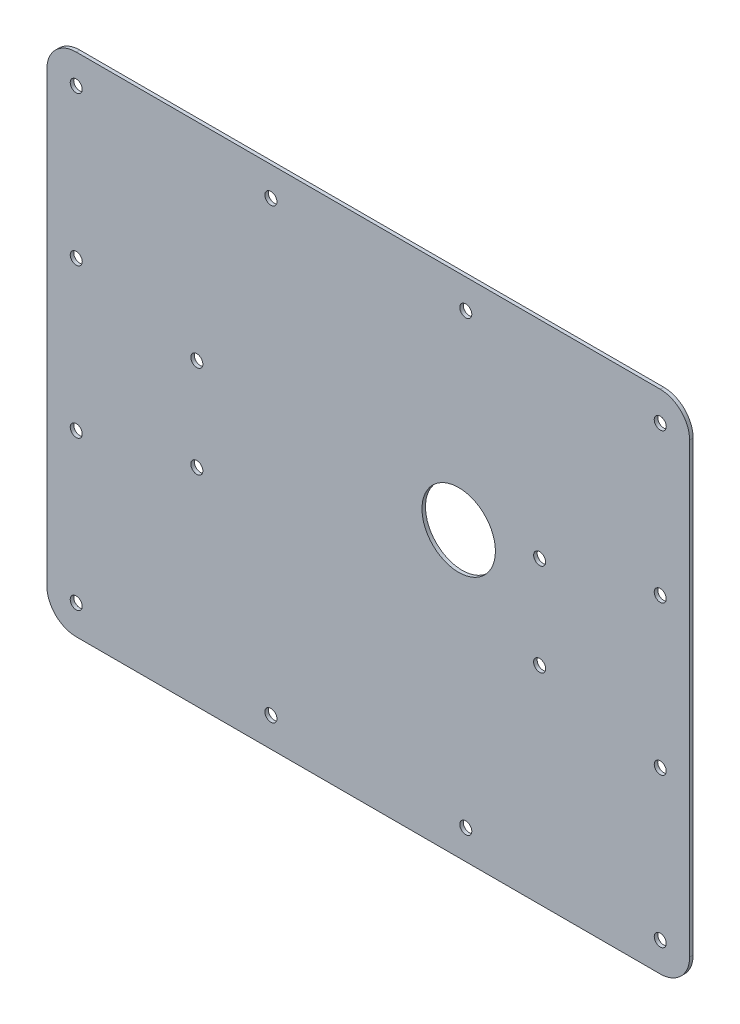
ISO-10303-21;
HEADER;
FILE_DESCRIPTION(('STEP AP214'),'2;1');
FILE_NAME('part.step','',(''),(''),'','','');
FILE_SCHEMA(('AUTOMOTIVE_DESIGN { 1 0 10303 214 1 1 1 1 }'));
ENDSEC;
DATA;
#1=APPLICATION_CONTEXT('core data for automotive mechanical design processes');
#2=APPLICATION_PROTOCOL_DEFINITION('international standard','automotive_design',2000,#1);
#3=PRODUCT_CONTEXT('',#1,'mechanical');
#4=PRODUCT('Part','Part','',(#3));
#5=PRODUCT_RELATED_PRODUCT_CATEGORY('part','',(#4));
#6=PRODUCT_DEFINITION_FORMATION('','',#4);
#7=PRODUCT_DEFINITION_CONTEXT('part definition',#1,'design');
#8=PRODUCT_DEFINITION('design','',#6,#7);
#9=PRODUCT_DEFINITION_SHAPE('','',#8);
#10=(LENGTH_UNIT() NAMED_UNIT(*) SI_UNIT(.MILLI.,.METRE.));
#11=(NAMED_UNIT(*) PLANE_ANGLE_UNIT() SI_UNIT($,.RADIAN.));
#12=(NAMED_UNIT(*) SI_UNIT($,.STERADIAN.) SOLID_ANGLE_UNIT());
#13=UNCERTAINTY_MEASURE_WITH_UNIT(LENGTH_MEASURE(1.E-05),#10,'distance_accuracy_value','');
#14=(GEOMETRIC_REPRESENTATION_CONTEXT(3) GLOBAL_UNCERTAINTY_ASSIGNED_CONTEXT((#13)) GLOBAL_UNIT_ASSIGNED_CONTEXT((#10,
#11,#12)) REPRESENTATION_CONTEXT('',''));
#15=CARTESIAN_POINT('',(0.,0.,0.));
#16=DIRECTION('',(0.,0.,1.));
#17=DIRECTION('',(1.,0.,0.));
#18=AXIS2_PLACEMENT_3D('',#15,#16,#17);
#19=CARTESIAN_POINT('',(126.238,96.774,1.51892));
#20=DIRECTION('',(0.,0.,1.));
#21=DIRECTION('',(1.,0.,0.));
#22=AXIS2_PLACEMENT_3D('',#19,#20,#21);
#23=PLANE('',#22);
#24=CARTESIAN_POINT('',(42.164,96.774,1.51892));
#25=DIRECTION('',(0.,0.,1.));
#26=DIRECTION('',(-1.,0.,0.));
#27=AXIS2_PLACEMENT_3D('',#24,#25,#26);
#28=CIRCLE('',#27,2.6);
#29=CARTESIAN_POINT('',(39.564,96.774,1.51892));
#30=VERTEX_POINT('',#29);
#31=EDGE_CURVE('E275',#30,#30,#28,.T.);
#32=ORIENTED_EDGE('',*,*,#31,.F.);
#33=EDGE_LOOP('',(#32));
#34=FACE_BOUND('',#33,.T.);
#35=CARTESIAN_POINT('',(-42.0793333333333,-96.774,1.51892));
#36=DIRECTION('',(0.,0.,1.));
#37=DIRECTION('',(1.,0.,0.));
#38=AXIS2_PLACEMENT_3D('',#35,#36,#37);
#39=CIRCLE('',#38,2.6);
#40=CARTESIAN_POINT('',(-39.4793333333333,-96.774,1.51892));
#41=VERTEX_POINT('',#40);
#42=EDGE_CURVE('E263',#41,#41,#39,.T.);
#43=ORIENTED_EDGE('',*,*,#42,.F.);
#44=EDGE_LOOP('',(#43));
#45=FACE_BOUND('',#44,.T.);
#46=CARTESIAN_POINT('',(126.238,-32.258,1.51892));
#47=DIRECTION('',(0.,0.,1.));
#48=DIRECTION('',(-1.,0.,0.));
#49=AXIS2_PLACEMENT_3D('',#46,#47,#48);
#50=CIRCLE('',#49,2.59999999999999);
#51=CARTESIAN_POINT('',(123.638,-32.258,1.51892));
#52=VERTEX_POINT('',#51);
#53=EDGE_CURVE('E251',#52,#52,#50,.T.);
#54=ORIENTED_EDGE('',*,*,#53,.F.);
#55=EDGE_LOOP('',(#54));
#56=FACE_BOUND('',#55,.T.);
#57=CARTESIAN_POINT('',(-126.238,-32.258,1.51892));
#58=DIRECTION('',(0.,0.,1.));
#59=DIRECTION('',(1.,0.,0.));
#60=AXIS2_PLACEMENT_3D('',#57,#58,#59);
#61=CIRCLE('',#60,2.6);
#62=CARTESIAN_POINT('',(-123.638,-32.258,1.51892));
#63=VERTEX_POINT('',#62);
#64=EDGE_CURVE('E239',#63,#63,#61,.T.);
#65=ORIENTED_EDGE('',*,*,#64,.F.);
#66=EDGE_LOOP('',(#65));
#67=FACE_BOUND('',#66,.T.);
#68=CARTESIAN_POINT('',(126.238,96.774,1.51892));
#69=DIRECTION('',(0.,0.,1.));
#70=DIRECTION('',(1.,0.,0.));
#71=AXIS2_PLACEMENT_3D('',#68,#69,#70);
#72=CIRCLE('',#71,2.59999999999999);
#73=CARTESIAN_POINT('',(128.838,96.774,1.51892));
#74=VERTEX_POINT('',#73);
#75=EDGE_CURVE('E227',#74,#74,#72,.T.);
#76=ORIENTED_EDGE('',*,*,#75,.F.);
#77=EDGE_LOOP('',(#76));
#78=FACE_BOUND('',#77,.T.);
#79=CARTESIAN_POINT('',(-74.1000000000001,20.,1.51892));
#80=DIRECTION('',(0.,0.,1.));
#81=DIRECTION('',(1.,0.,0.));
#82=AXIS2_PLACEMENT_3D('',#79,#80,#81);
#83=CIRCLE('',#82,2.6);
#84=CARTESIAN_POINT('',(-71.5000000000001,20.,1.51892));
#85=VERTEX_POINT('',#84);
#86=EDGE_CURVE('E215',#85,#85,#83,.T.);
#87=ORIENTED_EDGE('',*,*,#86,.F.);
#88=EDGE_LOOP('',(#87));
#89=FACE_BOUND('',#88,.T.);
#90=CARTESIAN_POINT('',(74.1,-20.,1.51892));
#91=DIRECTION('',(0.,0.,1.));
#92=DIRECTION('',(1.,0.,0.));
#93=AXIS2_PLACEMENT_3D('',#90,#91,#92);
#94=CIRCLE('',#93,2.6);
#95=CARTESIAN_POINT('',(76.7,-20.,1.51892));
#96=VERTEX_POINT('',#95);
#97=EDGE_CURVE('E203',#96,#96,#94,.T.);
#98=ORIENTED_EDGE('',*,*,#97,.F.);
#99=EDGE_LOOP('',(#98));
#100=FACE_BOUND('',#99,.T.);
#101=CARTESIAN_POINT('',(-74.1,-20.,1.51892));
#102=DIRECTION('',(0.,0.,1.));
#103=DIRECTION('',(1.,0.,0.));
#104=AXIS2_PLACEMENT_3D('',#101,#102,#103);
#105=CIRCLE('',#104,2.6);
#106=CARTESIAN_POINT('',(-71.5,-20.,1.51892));
#107=VERTEX_POINT('',#106);
#108=EDGE_CURVE('E191',#107,#107,#105,.T.);
#109=ORIENTED_EDGE('',*,*,#108,.F.);
#110=EDGE_LOOP('',(#109));
#111=FACE_BOUND('',#110,.T.);
#112=CARTESIAN_POINT('',(126.238,96.774,1.51892));
#113=DIRECTION('',(0.,0.,1.));
#114=DIRECTION('',(1.,0.,0.));
#115=AXIS2_PLACEMENT_3D('',#112,#113,#114);
#116=CIRCLE('',#115,12.7);
#117=CARTESIAN_POINT('',(138.938,96.774,1.51892));
#118=VERTEX_POINT('',#117);
#119=CARTESIAN_POINT('',(126.238,109.474,1.51892));
#120=VERTEX_POINT('',#119);
#121=EDGE_CURVE('E154',#118,#120,#116,.T.);
#122=ORIENTED_EDGE('',*,*,#121,.T.);
#123=DIRECTION('',(-1.,0.,0.));
#124=VECTOR('',#123,1.);
#125=CARTESIAN_POINT('',(-126.238,109.474,1.51892));
#126=LINE('',#125,#124);
#127=CARTESIAN_POINT('',(-126.238,109.474,1.51892));
#128=VERTEX_POINT('',#127);
#129=EDGE_CURVE('E102',#120,#128,#126,.T.);
#130=ORIENTED_EDGE('',*,*,#129,.T.);
#131=CARTESIAN_POINT('',(-126.238,96.774,1.51892));
#132=DIRECTION('',(0.,0.,1.));
#133=DIRECTION('',(-1.,0.,0.));
#134=AXIS2_PLACEMENT_3D('',#131,#132,#133);
#135=CIRCLE('',#134,12.7);
#136=CARTESIAN_POINT('',(-138.938,96.774,1.51892));
#137=VERTEX_POINT('',#136);
#138=EDGE_CURVE('E169',#128,#137,#135,.T.);
#139=ORIENTED_EDGE('',*,*,#138,.T.);
#140=DIRECTION('',(0.,-1.,0.));
#141=VECTOR('',#140,1.);
#142=CARTESIAN_POINT('',(-138.938,96.774,1.51892));
#143=LINE('',#142,#141);
#144=CARTESIAN_POINT('',(-138.938,-96.774,1.51892));
#145=VERTEX_POINT('',#144);
#146=EDGE_CURVE('E182',#137,#145,#143,.T.);
#147=ORIENTED_EDGE('',*,*,#146,.T.);
#148=CARTESIAN_POINT('',(-126.238,-96.774,1.51892));
#149=DIRECTION('',(0.,0.,1.));
#150=DIRECTION('',(-1.,0.,0.));
#151=AXIS2_PLACEMENT_3D('',#148,#149,#150);
#152=CIRCLE('',#151,12.7);
#153=CARTESIAN_POINT('',(-126.238,-109.474,1.51892));
#154=VERTEX_POINT('',#153);
#155=EDGE_CURVE('E121',#145,#154,#152,.T.);
#156=ORIENTED_EDGE('',*,*,#155,.T.);
#157=DIRECTION('',(1.,0.,0.));
#158=VECTOR('',#157,1.);
#159=CARTESIAN_POINT('',(-126.238,-109.474,1.51892));
#160=LINE('',#159,#158);
#161=CARTESIAN_POINT('',(126.238,-109.474,1.51892));
#162=VERTEX_POINT('',#161);
#163=EDGE_CURVE('E115',#154,#162,#160,.T.);
#164=ORIENTED_EDGE('',*,*,#163,.T.);
#165=CARTESIAN_POINT('',(126.238,-96.774,1.51892));
#166=DIRECTION('',(0.,0.,1.));
#167=DIRECTION('',(-1.,0.,0.));
#168=AXIS2_PLACEMENT_3D('',#165,#166,#167);
#169=CIRCLE('',#168,12.7);
#170=CARTESIAN_POINT('',(138.938,-96.774,1.51892));
#171=VERTEX_POINT('',#170);
#172=EDGE_CURVE('E119',#162,#171,#169,.T.);
#173=ORIENTED_EDGE('',*,*,#172,.T.);
#174=DIRECTION('',(0.,1.,0.));
#175=VECTOR('',#174,1.);
#176=CARTESIAN_POINT('',(138.938,96.774,1.51892));
#177=LINE('',#176,#175);
#178=EDGE_CURVE('E59',#171,#118,#177,.T.);
#179=ORIENTED_EDGE('',*,*,#178,.T.);
#180=EDGE_LOOP('',(#122,#130,#139,#147,#156,#164,#173,#179));
#181=FACE_BOUND('',#180,.T.);
#182=CARTESIAN_POINT('',(39.1,13.2,1.51892));
#183=DIRECTION('',(0.,0.,1.));
#184=DIRECTION('',(1.,0.,0.));
#185=AXIS2_PLACEMENT_3D('',#182,#183,#184);
#186=CIRCLE('',#185,15.875);
#187=CARTESIAN_POINT('',(54.975,13.2,1.51892));
#188=VERTEX_POINT('',#187);
#189=EDGE_CURVE('E143',#188,#188,#186,.T.);
#190=ORIENTED_EDGE('',*,*,#189,.F.);
#191=EDGE_LOOP('',(#190));
#192=FACE_BOUND('',#191,.T.);
#193=CARTESIAN_POINT('',(-126.238,-96.774,1.51892));
#194=DIRECTION('',(0.,0.,1.));
#195=DIRECTION('',(1.,0.,0.));
#196=AXIS2_PLACEMENT_3D('',#193,#194,#195);
#197=CIRCLE('',#196,2.6);
#198=CARTESIAN_POINT('',(-123.638,-96.774,1.51892));
#199=VERTEX_POINT('',#198);
#200=EDGE_CURVE('E197',#199,#199,#197,.T.);
#201=ORIENTED_EDGE('',*,*,#200,.F.);
#202=EDGE_LOOP('',(#201));
#203=FACE_BOUND('',#202,.T.);
#204=CARTESIAN_POINT('',(74.0999999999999,20.,1.51892));
#205=DIRECTION('',(0.,0.,1.));
#206=DIRECTION('',(1.,0.,0.));
#207=AXIS2_PLACEMENT_3D('',#204,#205,#206);
#208=CIRCLE('',#207,2.6);
#209=CARTESIAN_POINT('',(76.6999999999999,20.,1.51892));
#210=VERTEX_POINT('',#209);
#211=EDGE_CURVE('E209',#210,#210,#208,.T.);
#212=ORIENTED_EDGE('',*,*,#211,.F.);
#213=EDGE_LOOP('',(#212));
#214=FACE_BOUND('',#213,.T.);
#215=CARTESIAN_POINT('',(126.238,-96.774,1.51892));
#216=DIRECTION('',(0.,0.,1.));
#217=DIRECTION('',(-1.,0.,0.));
#218=AXIS2_PLACEMENT_3D('',#215,#216,#217);
#219=CIRCLE('',#218,2.59999999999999);
#220=CARTESIAN_POINT('',(123.638,-96.774,1.51892));
#221=VERTEX_POINT('',#220);
#222=EDGE_CURVE('E221',#221,#221,#219,.T.);
#223=ORIENTED_EDGE('',*,*,#222,.F.);
#224=EDGE_LOOP('',(#223));
#225=FACE_BOUND('',#224,.T.);
#226=CARTESIAN_POINT('',(-126.238,96.774,1.51892));
#227=DIRECTION('',(0.,0.,1.));
#228=DIRECTION('',(-1.,0.,0.));
#229=AXIS2_PLACEMENT_3D('',#226,#227,#228);
#230=CIRCLE('',#229,2.59999999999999);
#231=CARTESIAN_POINT('',(-128.838,96.774,1.51892));
#232=VERTEX_POINT('',#231);
#233=EDGE_CURVE('E233',#232,#232,#230,.T.);
#234=ORIENTED_EDGE('',*,*,#233,.F.);
#235=EDGE_LOOP('',(#234));
#236=FACE_BOUND('',#235,.T.);
#237=CARTESIAN_POINT('',(-126.238,32.258,1.51892));
#238=DIRECTION('',(0.,0.,1.));
#239=DIRECTION('',(1.,0.,0.));
#240=AXIS2_PLACEMENT_3D('',#237,#238,#239);
#241=CIRCLE('',#240,2.6);
#242=CARTESIAN_POINT('',(-123.638,32.258,1.51892));
#243=VERTEX_POINT('',#242);
#244=EDGE_CURVE('E245',#243,#243,#241,.T.);
#245=ORIENTED_EDGE('',*,*,#244,.F.);
#246=EDGE_LOOP('',(#245));
#247=FACE_BOUND('',#246,.T.);
#248=CARTESIAN_POINT('',(126.238,32.258,1.51892));
#249=DIRECTION('',(0.,0.,1.));
#250=DIRECTION('',(-1.,0.,0.));
#251=AXIS2_PLACEMENT_3D('',#248,#249,#250);
#252=CIRCLE('',#251,2.59999999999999);
#253=CARTESIAN_POINT('',(123.638,32.258,1.51892));
#254=VERTEX_POINT('',#253);
#255=EDGE_CURVE('E257',#254,#254,#252,.T.);
#256=ORIENTED_EDGE('',*,*,#255,.F.);
#257=EDGE_LOOP('',(#256));
#258=FACE_BOUND('',#257,.T.);
#259=CARTESIAN_POINT('',(42.164,-96.774,1.51892));
#260=DIRECTION('',(0.,0.,1.));
#261=DIRECTION('',(1.,0.,0.));
#262=AXIS2_PLACEMENT_3D('',#259,#260,#261);
#263=CIRCLE('',#262,2.6);
#264=CARTESIAN_POINT('',(44.764,-96.774,1.51892));
#265=VERTEX_POINT('',#264);
#266=EDGE_CURVE('E269',#265,#265,#263,.T.);
#267=ORIENTED_EDGE('',*,*,#266,.F.);
#268=EDGE_LOOP('',(#267));
#269=FACE_BOUND('',#268,.T.);
#270=CARTESIAN_POINT('',(-42.0793333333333,96.774,1.51892));
#271=DIRECTION('',(0.,0.,1.));
#272=DIRECTION('',(-1.,0.,0.));
#273=AXIS2_PLACEMENT_3D('',#270,#271,#272);
#274=CIRCLE('',#273,2.6);
#275=CARTESIAN_POINT('',(-44.6793333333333,96.774,1.51892));
#276=VERTEX_POINT('',#275);
#277=EDGE_CURVE('E281',#276,#276,#274,.T.);
#278=ORIENTED_EDGE('',*,*,#277,.F.);
#279=EDGE_LOOP('',(#278));
#280=FACE_BOUND('',#279,.T.);
#281=ADVANCED_FACE('F42',(#34,#45,#56,#67,#78,#89,#100,#111,#181,#192,#203,#214,#225,#236,#247,
#258,#269,#280),#23,.T.);
#282=CARTESIAN_POINT('',(126.238,96.774,0.));
#283=DIRECTION('',(0.,0.,1.));
#284=DIRECTION('',(1.,0.,0.));
#285=AXIS2_PLACEMENT_3D('',#282,#283,#284);
#286=PLANE('',#285);
#287=CARTESIAN_POINT('',(126.238,96.774,0.));
#288=DIRECTION('',(0.,0.,1.));
#289=DIRECTION('',(1.,0.,0.));
#290=AXIS2_PLACEMENT_3D('',#287,#288,#289);
#291=CIRCLE('',#290,12.7);
#292=CARTESIAN_POINT('',(138.938,96.774,0.));
#293=VERTEX_POINT('',#292);
#294=CARTESIAN_POINT('',(126.238,109.474,0.));
#295=VERTEX_POINT('',#294);
#296=EDGE_CURVE('E139',#293,#295,#291,.T.);
#297=ORIENTED_EDGE('',*,*,#296,.F.);
#298=DIRECTION('',(0.,1.,0.));
#299=VECTOR('',#298,1.);
#300=CARTESIAN_POINT('',(138.938,96.774,0.));
#301=LINE('',#300,#299);
#302=CARTESIAN_POINT('',(138.938,-96.774,0.));
#303=VERTEX_POINT('',#302);
#304=EDGE_CURVE('E94',#303,#293,#301,.T.);
#305=ORIENTED_EDGE('',*,*,#304,.F.);
#306=CARTESIAN_POINT('',(126.238,-96.774,0.));
#307=DIRECTION('',(0.,0.,1.));
#308=DIRECTION('',(-1.,0.,0.));
#309=AXIS2_PLACEMENT_3D('',#306,#307,#308);
#310=CIRCLE('',#309,12.7);
#311=CARTESIAN_POINT('',(126.238,-109.474,0.));
#312=VERTEX_POINT('',#311);
#313=EDGE_CURVE('E88',#312,#303,#310,.T.);
#314=ORIENTED_EDGE('',*,*,#313,.F.);
#315=DIRECTION('',(1.,0.,0.));
#316=VECTOR('',#315,1.);
#317=CARTESIAN_POINT('',(-126.238,-109.474,0.));
#318=LINE('',#317,#316);
#319=CARTESIAN_POINT('',(-126.238,-109.474,0.));
#320=VERTEX_POINT('',#319);
#321=EDGE_CURVE('E129',#320,#312,#318,.T.);
#322=ORIENTED_EDGE('',*,*,#321,.F.);
#323=CARTESIAN_POINT('',(-126.238,-96.774,0.));
#324=DIRECTION('',(0.,0.,1.));
#325=DIRECTION('',(-1.,0.,0.));
#326=AXIS2_PLACEMENT_3D('',#323,#324,#325);
#327=CIRCLE('',#326,12.7);
#328=CARTESIAN_POINT('',(-138.938,-96.774,0.));
#329=VERTEX_POINT('',#328);
#330=EDGE_CURVE('E149',#329,#320,#327,.T.);
#331=ORIENTED_EDGE('',*,*,#330,.F.);
#332=DIRECTION('',(0.,-1.,0.));
#333=VECTOR('',#332,1.);
#334=CARTESIAN_POINT('',(-138.938,96.774,0.));
#335=LINE('',#334,#333);
#336=CARTESIAN_POINT('',(-138.938,96.774,0.));
#337=VERTEX_POINT('',#336);
#338=EDGE_CURVE('E147',#337,#329,#335,.T.);
#339=ORIENTED_EDGE('',*,*,#338,.F.);
#340=CARTESIAN_POINT('',(-126.238,96.774,0.));
#341=DIRECTION('',(0.,0.,1.));
#342=DIRECTION('',(-1.,0.,0.));
#343=AXIS2_PLACEMENT_3D('',#340,#341,#342);
#344=CIRCLE('',#343,12.7);
#345=CARTESIAN_POINT('',(-126.238,109.474,0.));
#346=VERTEX_POINT('',#345);
#347=EDGE_CURVE('E145',#346,#337,#344,.T.);
#348=ORIENTED_EDGE('',*,*,#347,.F.);
#349=DIRECTION('',(-1.,0.,0.));
#350=VECTOR('',#349,1.);
#351=CARTESIAN_POINT('',(-126.238,109.474,0.));
#352=LINE('',#351,#350);
#353=EDGE_CURVE('E142',#295,#346,#352,.T.);
#354=ORIENTED_EDGE('',*,*,#353,.F.);
#355=EDGE_LOOP('',(#297,#305,#314,#322,#331,#339,#348,#354));
#356=FACE_BOUND('',#355,.T.);
#357=CARTESIAN_POINT('',(39.1,13.2,0.));
#358=DIRECTION('',(0.,0.,1.));
#359=DIRECTION('',(1.,0.,0.));
#360=AXIS2_PLACEMENT_3D('',#357,#358,#359);
#361=CIRCLE('',#360,15.875);
#362=CARTESIAN_POINT('',(54.975,13.2,0.));
#363=VERTEX_POINT('',#362);
#364=EDGE_CURVE('E188',#363,#363,#361,.T.);
#365=ORIENTED_EDGE('',*,*,#364,.T.);
#366=EDGE_LOOP('',(#365));
#367=FACE_BOUND('',#366,.T.);
#368=CARTESIAN_POINT('',(-74.1,-20.,0.));
#369=DIRECTION('',(0.,0.,1.));
#370=DIRECTION('',(1.,0.,0.));
#371=AXIS2_PLACEMENT_3D('',#368,#369,#370);
#372=CIRCLE('',#371,2.6);
#373=CARTESIAN_POINT('',(-71.5,-20.,0.));
#374=VERTEX_POINT('',#373);
#375=EDGE_CURVE('E194',#374,#374,#372,.T.);
#376=ORIENTED_EDGE('',*,*,#375,.T.);
#377=EDGE_LOOP('',(#376));
#378=FACE_BOUND('',#377,.T.);
#379=CARTESIAN_POINT('',(-126.238,-96.774,0.));
#380=DIRECTION('',(0.,0.,1.));
#381=DIRECTION('',(1.,0.,0.));
#382=AXIS2_PLACEMENT_3D('',#379,#380,#381);
#383=CIRCLE('',#382,2.6);
#384=CARTESIAN_POINT('',(-123.638,-96.774,0.));
#385=VERTEX_POINT('',#384);
#386=EDGE_CURVE('E200',#385,#385,#383,.T.);
#387=ORIENTED_EDGE('',*,*,#386,.T.);
#388=EDGE_LOOP('',(#387));
#389=FACE_BOUND('',#388,.T.);
#390=CARTESIAN_POINT('',(74.1,-20.,0.));
#391=DIRECTION('',(0.,0.,1.));
#392=DIRECTION('',(1.,0.,0.));
#393=AXIS2_PLACEMENT_3D('',#390,#391,#392);
#394=CIRCLE('',#393,2.6);
#395=CARTESIAN_POINT('',(76.7,-20.,0.));
#396=VERTEX_POINT('',#395);
#397=EDGE_CURVE('E206',#396,#396,#394,.T.);
#398=ORIENTED_EDGE('',*,*,#397,.T.);
#399=EDGE_LOOP('',(#398));
#400=FACE_BOUND('',#399,.T.);
#401=CARTESIAN_POINT('',(74.0999999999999,20.,0.));
#402=DIRECTION('',(0.,0.,1.));
#403=DIRECTION('',(1.,0.,0.));
#404=AXIS2_PLACEMENT_3D('',#401,#402,#403);
#405=CIRCLE('',#404,2.6);
#406=CARTESIAN_POINT('',(76.6999999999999,20.,0.));
#407=VERTEX_POINT('',#406);
#408=EDGE_CURVE('E212',#407,#407,#405,.T.);
#409=ORIENTED_EDGE('',*,*,#408,.T.);
#410=EDGE_LOOP('',(#409));
#411=FACE_BOUND('',#410,.T.);
#412=CARTESIAN_POINT('',(-74.1000000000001,20.,0.));
#413=DIRECTION('',(0.,0.,1.));
#414=DIRECTION('',(1.,0.,0.));
#415=AXIS2_PLACEMENT_3D('',#412,#413,#414);
#416=CIRCLE('',#415,2.6);
#417=CARTESIAN_POINT('',(-71.5000000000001,20.,0.));
#418=VERTEX_POINT('',#417);
#419=EDGE_CURVE('E218',#418,#418,#416,.T.);
#420=ORIENTED_EDGE('',*,*,#419,.T.);
#421=EDGE_LOOP('',(#420));
#422=FACE_BOUND('',#421,.T.);
#423=CARTESIAN_POINT('',(126.238,-96.774,0.));
#424=DIRECTION('',(0.,0.,1.));
#425=DIRECTION('',(-1.,0.,0.));
#426=AXIS2_PLACEMENT_3D('',#423,#424,#425);
#427=CIRCLE('',#426,2.59999999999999);
#428=CARTESIAN_POINT('',(123.638,-96.774,0.));
#429=VERTEX_POINT('',#428);
#430=EDGE_CURVE('E224',#429,#429,#427,.T.);
#431=ORIENTED_EDGE('',*,*,#430,.T.);
#432=EDGE_LOOP('',(#431));
#433=FACE_BOUND('',#432,.T.);
#434=CARTESIAN_POINT('',(126.238,96.774,0.));
#435=DIRECTION('',(0.,0.,1.));
#436=DIRECTION('',(1.,0.,0.));
#437=AXIS2_PLACEMENT_3D('',#434,#435,#436);
#438=CIRCLE('',#437,2.59999999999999);
#439=CARTESIAN_POINT('',(128.838,96.774,0.));
#440=VERTEX_POINT('',#439);
#441=EDGE_CURVE('E230',#440,#440,#438,.T.);
#442=ORIENTED_EDGE('',*,*,#441,.T.);
#443=EDGE_LOOP('',(#442));
#444=FACE_BOUND('',#443,.T.);
#445=CARTESIAN_POINT('',(-126.238,96.774,0.));
#446=DIRECTION('',(0.,0.,1.));
#447=DIRECTION('',(-1.,0.,0.));
#448=AXIS2_PLACEMENT_3D('',#445,#446,#447);
#449=CIRCLE('',#448,2.59999999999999);
#450=CARTESIAN_POINT('',(-128.838,96.774,0.));
#451=VERTEX_POINT('',#450);
#452=EDGE_CURVE('E236',#451,#451,#449,.T.);
#453=ORIENTED_EDGE('',*,*,#452,.T.);
#454=EDGE_LOOP('',(#453));
#455=FACE_BOUND('',#454,.T.);
#456=CARTESIAN_POINT('',(-126.238,-32.258,0.));
#457=DIRECTION('',(0.,0.,1.));
#458=DIRECTION('',(1.,0.,0.));
#459=AXIS2_PLACEMENT_3D('',#456,#457,#458);
#460=CIRCLE('',#459,2.6);
#461=CARTESIAN_POINT('',(-123.638,-32.258,0.));
#462=VERTEX_POINT('',#461);
#463=EDGE_CURVE('E242',#462,#462,#460,.T.);
#464=ORIENTED_EDGE('',*,*,#463,.T.);
#465=EDGE_LOOP('',(#464));
#466=FACE_BOUND('',#465,.T.);
#467=CARTESIAN_POINT('',(-126.238,32.258,0.));
#468=DIRECTION('',(0.,0.,1.));
#469=DIRECTION('',(1.,0.,0.));
#470=AXIS2_PLACEMENT_3D('',#467,#468,#469);
#471=CIRCLE('',#470,2.6);
#472=CARTESIAN_POINT('',(-123.638,32.258,0.));
#473=VERTEX_POINT('',#472);
#474=EDGE_CURVE('E248',#473,#473,#471,.T.);
#475=ORIENTED_EDGE('',*,*,#474,.T.);
#476=EDGE_LOOP('',(#475));
#477=FACE_BOUND('',#476,.T.);
#478=CARTESIAN_POINT('',(126.238,-32.258,0.));
#479=DIRECTION('',(0.,0.,1.));
#480=DIRECTION('',(-1.,0.,0.));
#481=AXIS2_PLACEMENT_3D('',#478,#479,#480);
#482=CIRCLE('',#481,2.59999999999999);
#483=CARTESIAN_POINT('',(123.638,-32.258,0.));
#484=VERTEX_POINT('',#483);
#485=EDGE_CURVE('E254',#484,#484,#482,.T.);
#486=ORIENTED_EDGE('',*,*,#485,.T.);
#487=EDGE_LOOP('',(#486));
#488=FACE_BOUND('',#487,.T.);
#489=CARTESIAN_POINT('',(126.238,32.258,0.));
#490=DIRECTION('',(0.,0.,1.));
#491=DIRECTION('',(-1.,0.,0.));
#492=AXIS2_PLACEMENT_3D('',#489,#490,#491);
#493=CIRCLE('',#492,2.59999999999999);
#494=CARTESIAN_POINT('',(123.638,32.258,0.));
#495=VERTEX_POINT('',#494);
#496=EDGE_CURVE('E260',#495,#495,#493,.T.);
#497=ORIENTED_EDGE('',*,*,#496,.T.);
#498=EDGE_LOOP('',(#497));
#499=FACE_BOUND('',#498,.T.);
#500=CARTESIAN_POINT('',(-42.0793333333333,-96.774,0.));
#501=DIRECTION('',(0.,0.,1.));
#502=DIRECTION('',(1.,0.,0.));
#503=AXIS2_PLACEMENT_3D('',#500,#501,#502);
#504=CIRCLE('',#503,2.6);
#505=CARTESIAN_POINT('',(-39.4793333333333,-96.774,0.));
#506=VERTEX_POINT('',#505);
#507=EDGE_CURVE('E266',#506,#506,#504,.T.);
#508=ORIENTED_EDGE('',*,*,#507,.T.);
#509=EDGE_LOOP('',(#508));
#510=FACE_BOUND('',#509,.T.);
#511=CARTESIAN_POINT('',(42.164,-96.774,0.));
#512=DIRECTION('',(0.,0.,1.));
#513=DIRECTION('',(1.,0.,0.));
#514=AXIS2_PLACEMENT_3D('',#511,#512,#513);
#515=CIRCLE('',#514,2.6);
#516=CARTESIAN_POINT('',(44.764,-96.774,0.));
#517=VERTEX_POINT('',#516);
#518=EDGE_CURVE('E272',#517,#517,#515,.T.);
#519=ORIENTED_EDGE('',*,*,#518,.T.);
#520=EDGE_LOOP('',(#519));
#521=FACE_BOUND('',#520,.T.);
#522=CARTESIAN_POINT('',(42.164,96.774,0.));
#523=DIRECTION('',(0.,0.,1.));
#524=DIRECTION('',(-1.,0.,0.));
#525=AXIS2_PLACEMENT_3D('',#522,#523,#524);
#526=CIRCLE('',#525,2.6);
#527=CARTESIAN_POINT('',(39.564,96.774,0.));
#528=VERTEX_POINT('',#527);
#529=EDGE_CURVE('E278',#528,#528,#526,.T.);
#530=ORIENTED_EDGE('',*,*,#529,.T.);
#531=EDGE_LOOP('',(#530));
#532=FACE_BOUND('',#531,.T.);
#533=CARTESIAN_POINT('',(-42.0793333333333,96.774,0.));
#534=DIRECTION('',(0.,0.,1.));
#535=DIRECTION('',(-1.,0.,0.));
#536=AXIS2_PLACEMENT_3D('',#533,#534,#535);
#537=CIRCLE('',#536,2.6);
#538=CARTESIAN_POINT('',(-44.6793333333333,96.774,0.));
#539=VERTEX_POINT('',#538);
#540=EDGE_CURVE('E284',#539,#539,#537,.T.);
#541=ORIENTED_EDGE('',*,*,#540,.T.);
#542=EDGE_LOOP('',(#541));
#543=FACE_BOUND('',#542,.T.);
#544=ADVANCED_FACE('F173',(#356,#367,#378,#389,#400,#411,#422,#433,#444,#455,#466,#477,#488,
#499,#510,#521,#532,#543),#286,.F.);
#545=CARTESIAN_POINT('',(126.238,96.774,1.51892));
#546=DIRECTION('',(0.,0.,-1.));
#547=DIRECTION('',(-1.,0.,0.));
#548=AXIS2_PLACEMENT_3D('',#545,#546,#547);
#549=CYLINDRICAL_SURFACE('',#548,12.7);
#550=ORIENTED_EDGE('',*,*,#296,.T.);
#551=DIRECTION('',(0.,0.,-1.));
#552=VECTOR('',#551,1.);
#553=CARTESIAN_POINT('',(126.238,109.474,1.51892));
#554=LINE('',#553,#552);
#555=EDGE_CURVE('E11',#120,#295,#554,.T.);
#556=ORIENTED_EDGE('',*,*,#555,.F.);
#557=ORIENTED_EDGE('',*,*,#121,.F.);
#558=DIRECTION('',(0.,0.,-1.));
#559=VECTOR('',#558,1.);
#560=CARTESIAN_POINT('',(138.938,96.774,1.51892));
#561=LINE('',#560,#559);
#562=EDGE_CURVE('E135',#118,#293,#561,.T.);
#563=ORIENTED_EDGE('',*,*,#562,.T.);
#564=EDGE_LOOP('',(#550,#556,#557,#563));
#565=FACE_BOUND('',#564,.T.);
#566=ADVANCED_FACE('F44',(#565),#549,.T.);
#567=CARTESIAN_POINT('',(-126.238,109.474,1.51892));
#568=DIRECTION('',(0.,-1.,0.));
#569=DIRECTION('',(0.,0.,-1.));
#570=AXIS2_PLACEMENT_3D('',#567,#568,#569);
#571=PLANE('',#570);
#572=ORIENTED_EDGE('',*,*,#353,.T.);
#573=DIRECTION('',(0.,0.,-1.));
#574=VECTOR('',#573,1.);
#575=CARTESIAN_POINT('',(-126.238,109.474,1.51892));
#576=LINE('',#575,#574);
#577=EDGE_CURVE('E51',#128,#346,#576,.T.);
#578=ORIENTED_EDGE('',*,*,#577,.F.);
#579=ORIENTED_EDGE('',*,*,#129,.F.);
#580=ORIENTED_EDGE('',*,*,#555,.T.);
#581=EDGE_LOOP('',(#572,#578,#579,#580));
#582=FACE_BOUND('',#581,.T.);
#583=ADVANCED_FACE('F318',(#582),#571,.F.);
#584=CARTESIAN_POINT('',(-126.238,96.774,1.51892));
#585=DIRECTION('',(0.,0.,-1.));
#586=DIRECTION('',(-1.,0.,0.));
#587=AXIS2_PLACEMENT_3D('',#584,#585,#586);
#588=CYLINDRICAL_SURFACE('',#587,12.7);
#589=ORIENTED_EDGE('',*,*,#347,.T.);
#590=DIRECTION('',(0.,0.,-1.));
#591=VECTOR('',#590,1.);
#592=CARTESIAN_POINT('',(-138.938,96.774,1.51892));
#593=LINE('',#592,#591);
#594=EDGE_CURVE('E161',#137,#337,#593,.T.);
#595=ORIENTED_EDGE('',*,*,#594,.F.);
#596=ORIENTED_EDGE('',*,*,#138,.F.);
#597=ORIENTED_EDGE('',*,*,#577,.T.);
#598=EDGE_LOOP('',(#589,#595,#596,#597));
#599=FACE_BOUND('',#598,.T.);
#600=ADVANCED_FACE('F167',(#599),#588,.T.);
#601=CARTESIAN_POINT('',(-138.938,96.774,1.51892));
#602=DIRECTION('',(1.,0.,0.));
#603=DIRECTION('',(0.,0.,-1.));
#604=AXIS2_PLACEMENT_3D('',#601,#602,#603);
#605=PLANE('',#604);
#606=ORIENTED_EDGE('',*,*,#338,.T.);
#607=DIRECTION('',(0.,0.,-1.));
#608=VECTOR('',#607,1.);
#609=CARTESIAN_POINT('',(-138.938,-96.774,1.51892));
#610=LINE('',#609,#608);
#611=EDGE_CURVE('E158',#145,#329,#610,.T.);
#612=ORIENTED_EDGE('',*,*,#611,.F.);
#613=ORIENTED_EDGE('',*,*,#146,.F.);
#614=ORIENTED_EDGE('',*,*,#594,.T.);
#615=EDGE_LOOP('',(#606,#612,#613,#614));
#616=FACE_BOUND('',#615,.T.);
#617=ADVANCED_FACE('F178',(#616),#605,.F.);
#618=CARTESIAN_POINT('',(-126.238,-96.774,1.51892));
#619=DIRECTION('',(0.,0.,-1.));
#620=DIRECTION('',(-1.,0.,0.));
#621=AXIS2_PLACEMENT_3D('',#618,#619,#620);
#622=CYLINDRICAL_SURFACE('',#621,12.7);
#623=ORIENTED_EDGE('',*,*,#330,.T.);
#624=DIRECTION('',(0.,0.,-1.));
#625=VECTOR('',#624,1.);
#626=CARTESIAN_POINT('',(-126.238,-109.474,1.51892));
#627=LINE('',#626,#625);
#628=EDGE_CURVE('E130',#154,#320,#627,.T.);
#629=ORIENTED_EDGE('',*,*,#628,.F.);
#630=ORIENTED_EDGE('',*,*,#155,.F.);
#631=ORIENTED_EDGE('',*,*,#611,.T.);
#632=EDGE_LOOP('',(#623,#629,#630,#631));
#633=FACE_BOUND('',#632,.T.);
#634=ADVANCED_FACE('F181',(#633),#622,.T.);
#635=CARTESIAN_POINT('',(-126.238,-109.474,1.51892));
#636=DIRECTION('',(0.,1.,0.));
#637=DIRECTION('',(0.,0.,1.));
#638=AXIS2_PLACEMENT_3D('',#635,#636,#637);
#639=PLANE('',#638);
#640=ORIENTED_EDGE('',*,*,#321,.T.);
#641=DIRECTION('',(0.,0.,-1.));
#642=VECTOR('',#641,1.);
#643=CARTESIAN_POINT('',(126.238,-109.474,1.51892));
#644=LINE('',#643,#642);
#645=EDGE_CURVE('E126',#162,#312,#644,.T.);
#646=ORIENTED_EDGE('',*,*,#645,.F.);
#647=ORIENTED_EDGE('',*,*,#163,.F.);
#648=ORIENTED_EDGE('',*,*,#628,.T.);
#649=EDGE_LOOP('',(#640,#646,#647,#648));
#650=FACE_BOUND('',#649,.T.);
#651=ADVANCED_FACE('F127',(#650),#639,.F.);
#652=CARTESIAN_POINT('',(126.238,-96.774,1.51892));
#653=DIRECTION('',(0.,0.,-1.));
#654=DIRECTION('',(-1.,0.,0.));
#655=AXIS2_PLACEMENT_3D('',#652,#653,#654);
#656=CYLINDRICAL_SURFACE('',#655,12.7);
#657=ORIENTED_EDGE('',*,*,#313,.T.);
#658=DIRECTION('',(0.,0.,-1.));
#659=VECTOR('',#658,1.);
#660=CARTESIAN_POINT('',(138.938,-96.774,1.51892));
#661=LINE('',#660,#659);
#662=EDGE_CURVE('E131',#171,#303,#661,.T.);
#663=ORIENTED_EDGE('',*,*,#662,.F.);
#664=ORIENTED_EDGE('',*,*,#172,.F.);
#665=ORIENTED_EDGE('',*,*,#645,.T.);
#666=EDGE_LOOP('',(#657,#663,#664,#665));
#667=FACE_BOUND('',#666,.T.);
#668=ADVANCED_FACE('F133',(#667),#656,.T.);
#669=CARTESIAN_POINT('',(138.938,96.774,1.51892));
#670=DIRECTION('',(-1.,0.,0.));
#671=DIRECTION('',(0.,0.,1.));
#672=AXIS2_PLACEMENT_3D('',#669,#670,#671);
#673=PLANE('',#672);
#674=ORIENTED_EDGE('',*,*,#304,.T.);
#675=ORIENTED_EDGE('',*,*,#562,.F.);
#676=ORIENTED_EDGE('',*,*,#178,.F.);
#677=ORIENTED_EDGE('',*,*,#662,.T.);
#678=EDGE_LOOP('',(#674,#675,#676,#677));
#679=FACE_BOUND('',#678,.T.);
#680=ADVANCED_FACE('F306',(#679),#673,.F.);
#681=CARTESIAN_POINT('',(39.1,13.2,1.51892));
#682=DIRECTION('',(0.,0.,-1.));
#683=DIRECTION('',(-1.,0.,0.));
#684=AXIS2_PLACEMENT_3D('',#681,#682,#683);
#685=CYLINDRICAL_SURFACE('',#684,15.875);
#686=ORIENTED_EDGE('',*,*,#189,.T.);
#687=EDGE_LOOP('',(#686));
#688=FACE_BOUND('',#687,.T.);
#689=ORIENTED_EDGE('',*,*,#364,.F.);
#690=EDGE_LOOP('',(#689));
#691=FACE_BOUND('',#690,.T.);
#692=ADVANCED_FACE('F303',(#688,#691),#685,.F.);
#693=CARTESIAN_POINT('',(-74.1,-20.,1.51892));
#694=DIRECTION('',(0.,0.,-1.));
#695=DIRECTION('',(-1.,0.,0.));
#696=AXIS2_PLACEMENT_3D('',#693,#694,#695);
#697=CYLINDRICAL_SURFACE('',#696,2.6);
#698=ORIENTED_EDGE('',*,*,#108,.T.);
#699=EDGE_LOOP('',(#698));
#700=FACE_BOUND('',#699,.T.);
#701=ORIENTED_EDGE('',*,*,#375,.F.);
#702=EDGE_LOOP('',(#701));
#703=FACE_BOUND('',#702,.T.);
#704=ADVANCED_FACE('F415',(#700,#703),#697,.F.);
#705=CARTESIAN_POINT('',(-126.238,-96.774,1.51892));
#706=DIRECTION('',(0.,0.,-1.));
#707=DIRECTION('',(-1.,0.,0.));
#708=AXIS2_PLACEMENT_3D('',#705,#706,#707);
#709=CYLINDRICAL_SURFACE('',#708,2.6);
#710=ORIENTED_EDGE('',*,*,#200,.T.);
#711=EDGE_LOOP('',(#710));
#712=FACE_BOUND('',#711,.T.);
#713=ORIENTED_EDGE('',*,*,#386,.F.);
#714=EDGE_LOOP('',(#713));
#715=FACE_BOUND('',#714,.T.);
#716=ADVANCED_FACE('F426',(#712,#715),#709,.F.);
#717=CARTESIAN_POINT('',(74.1,-20.,1.51892));
#718=DIRECTION('',(0.,0.,-1.));
#719=DIRECTION('',(-1.,0.,0.));
#720=AXIS2_PLACEMENT_3D('',#717,#718,#719);
#721=CYLINDRICAL_SURFACE('',#720,2.6);
#722=ORIENTED_EDGE('',*,*,#97,.T.);
#723=EDGE_LOOP('',(#722));
#724=FACE_BOUND('',#723,.T.);
#725=ORIENTED_EDGE('',*,*,#397,.F.);
#726=EDGE_LOOP('',(#725));
#727=FACE_BOUND('',#726,.T.);
#728=ADVANCED_FACE('F437',(#724,#727),#721,.F.);
#729=CARTESIAN_POINT('',(74.0999999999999,20.,1.51892));
#730=DIRECTION('',(0.,0.,-1.));
#731=DIRECTION('',(-1.,0.,0.));
#732=AXIS2_PLACEMENT_3D('',#729,#730,#731);
#733=CYLINDRICAL_SURFACE('',#732,2.6);
#734=ORIENTED_EDGE('',*,*,#211,.T.);
#735=EDGE_LOOP('',(#734));
#736=FACE_BOUND('',#735,.T.);
#737=ORIENTED_EDGE('',*,*,#408,.F.);
#738=EDGE_LOOP('',(#737));
#739=FACE_BOUND('',#738,.T.);
#740=ADVANCED_FACE('F449',(#736,#739),#733,.F.);
#741=CARTESIAN_POINT('',(-74.1000000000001,20.,1.51892));
#742=DIRECTION('',(0.,0.,-1.));
#743=DIRECTION('',(-1.,0.,0.));
#744=AXIS2_PLACEMENT_3D('',#741,#742,#743);
#745=CYLINDRICAL_SURFACE('',#744,2.6);
#746=ORIENTED_EDGE('',*,*,#86,.T.);
#747=EDGE_LOOP('',(#746));
#748=FACE_BOUND('',#747,.T.);
#749=ORIENTED_EDGE('',*,*,#419,.F.);
#750=EDGE_LOOP('',(#749));
#751=FACE_BOUND('',#750,.T.);
#752=ADVANCED_FACE('F461',(#748,#751),#745,.F.);
#753=CARTESIAN_POINT('',(126.238,-96.774,1.51892));
#754=DIRECTION('',(0.,0.,-1.));
#755=DIRECTION('',(-1.,0.,0.));
#756=AXIS2_PLACEMENT_3D('',#753,#754,#755);
#757=CYLINDRICAL_SURFACE('',#756,2.59999999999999);
#758=ORIENTED_EDGE('',*,*,#222,.T.);
#759=EDGE_LOOP('',(#758));
#760=FACE_BOUND('',#759,.T.);
#761=ORIENTED_EDGE('',*,*,#430,.F.);
#762=EDGE_LOOP('',(#761));
#763=FACE_BOUND('',#762,.T.);
#764=ADVANCED_FACE('F473',(#760,#763),#757,.F.);
#765=CARTESIAN_POINT('',(126.238,96.774,1.51892));
#766=DIRECTION('',(0.,0.,-1.));
#767=DIRECTION('',(-1.,0.,0.));
#768=AXIS2_PLACEMENT_3D('',#765,#766,#767);
#769=CYLINDRICAL_SURFACE('',#768,2.59999999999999);
#770=ORIENTED_EDGE('',*,*,#75,.T.);
#771=EDGE_LOOP('',(#770));
#772=FACE_BOUND('',#771,.T.);
#773=ORIENTED_EDGE('',*,*,#441,.F.);
#774=EDGE_LOOP('',(#773));
#775=FACE_BOUND('',#774,.T.);
#776=ADVANCED_FACE('F485',(#772,#775),#769,.F.);
#777=CARTESIAN_POINT('',(-126.238,96.774,1.51892));
#778=DIRECTION('',(0.,0.,-1.));
#779=DIRECTION('',(-1.,0.,0.));
#780=AXIS2_PLACEMENT_3D('',#777,#778,#779);
#781=CYLINDRICAL_SURFACE('',#780,2.59999999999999);
#782=ORIENTED_EDGE('',*,*,#233,.T.);
#783=EDGE_LOOP('',(#782));
#784=FACE_BOUND('',#783,.T.);
#785=ORIENTED_EDGE('',*,*,#452,.F.);
#786=EDGE_LOOP('',(#785));
#787=FACE_BOUND('',#786,.T.);
#788=ADVANCED_FACE('F497',(#784,#787),#781,.F.);
#789=CARTESIAN_POINT('',(-126.238,-32.258,1.51892));
#790=DIRECTION('',(0.,0.,-1.));
#791=DIRECTION('',(-1.,0.,0.));
#792=AXIS2_PLACEMENT_3D('',#789,#790,#791);
#793=CYLINDRICAL_SURFACE('',#792,2.6);
#794=ORIENTED_EDGE('',*,*,#64,.T.);
#795=EDGE_LOOP('',(#794));
#796=FACE_BOUND('',#795,.T.);
#797=ORIENTED_EDGE('',*,*,#463,.F.);
#798=EDGE_LOOP('',(#797));
#799=FACE_BOUND('',#798,.T.);
#800=ADVANCED_FACE('F509',(#796,#799),#793,.F.);
#801=CARTESIAN_POINT('',(-126.238,32.258,1.51892));
#802=DIRECTION('',(0.,0.,-1.));
#803=DIRECTION('',(-1.,0.,0.));
#804=AXIS2_PLACEMENT_3D('',#801,#802,#803);
#805=CYLINDRICAL_SURFACE('',#804,2.6);
#806=ORIENTED_EDGE('',*,*,#244,.T.);
#807=EDGE_LOOP('',(#806));
#808=FACE_BOUND('',#807,.T.);
#809=ORIENTED_EDGE('',*,*,#474,.F.);
#810=EDGE_LOOP('',(#809));
#811=FACE_BOUND('',#810,.T.);
#812=ADVANCED_FACE('F521',(#808,#811),#805,.F.);
#813=CARTESIAN_POINT('',(126.238,-32.258,1.51892));
#814=DIRECTION('',(0.,0.,-1.));
#815=DIRECTION('',(-1.,0.,0.));
#816=AXIS2_PLACEMENT_3D('',#813,#814,#815);
#817=CYLINDRICAL_SURFACE('',#816,2.59999999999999);
#818=ORIENTED_EDGE('',*,*,#53,.T.);
#819=EDGE_LOOP('',(#818));
#820=FACE_BOUND('',#819,.T.);
#821=ORIENTED_EDGE('',*,*,#485,.F.);
#822=EDGE_LOOP('',(#821));
#823=FACE_BOUND('',#822,.T.);
#824=ADVANCED_FACE('F533',(#820,#823),#817,.F.);
#825=CARTESIAN_POINT('',(126.238,32.258,1.51892));
#826=DIRECTION('',(0.,0.,-1.));
#827=DIRECTION('',(-1.,0.,0.));
#828=AXIS2_PLACEMENT_3D('',#825,#826,#827);
#829=CYLINDRICAL_SURFACE('',#828,2.59999999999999);
#830=ORIENTED_EDGE('',*,*,#255,.T.);
#831=EDGE_LOOP('',(#830));
#832=FACE_BOUND('',#831,.T.);
#833=ORIENTED_EDGE('',*,*,#496,.F.);
#834=EDGE_LOOP('',(#833));
#835=FACE_BOUND('',#834,.T.);
#836=ADVANCED_FACE('F545',(#832,#835),#829,.F.);
#837=CARTESIAN_POINT('',(-42.0793333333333,-96.774,1.51892));
#838=DIRECTION('',(0.,0.,-1.));
#839=DIRECTION('',(-1.,0.,0.));
#840=AXIS2_PLACEMENT_3D('',#837,#838,#839);
#841=CYLINDRICAL_SURFACE('',#840,2.6);
#842=ORIENTED_EDGE('',*,*,#42,.T.);
#843=EDGE_LOOP('',(#842));
#844=FACE_BOUND('',#843,.T.);
#845=ORIENTED_EDGE('',*,*,#507,.F.);
#846=EDGE_LOOP('',(#845));
#847=FACE_BOUND('',#846,.T.);
#848=ADVANCED_FACE('F557',(#844,#847),#841,.F.);
#849=CARTESIAN_POINT('',(42.164,-96.774,1.51892));
#850=DIRECTION('',(0.,0.,-1.));
#851=DIRECTION('',(-1.,0.,0.));
#852=AXIS2_PLACEMENT_3D('',#849,#850,#851);
#853=CYLINDRICAL_SURFACE('',#852,2.6);
#854=ORIENTED_EDGE('',*,*,#266,.T.);
#855=EDGE_LOOP('',(#854));
#856=FACE_BOUND('',#855,.T.);
#857=ORIENTED_EDGE('',*,*,#518,.F.);
#858=EDGE_LOOP('',(#857));
#859=FACE_BOUND('',#858,.T.);
#860=ADVANCED_FACE('F569',(#856,#859),#853,.F.);
#861=CARTESIAN_POINT('',(42.164,96.774,1.51892));
#862=DIRECTION('',(0.,0.,-1.));
#863=DIRECTION('',(-1.,0.,0.));
#864=AXIS2_PLACEMENT_3D('',#861,#862,#863);
#865=CYLINDRICAL_SURFACE('',#864,2.6);
#866=ORIENTED_EDGE('',*,*,#31,.T.);
#867=EDGE_LOOP('',(#866));
#868=FACE_BOUND('',#867,.T.);
#869=ORIENTED_EDGE('',*,*,#529,.F.);
#870=EDGE_LOOP('',(#869));
#871=FACE_BOUND('',#870,.T.);
#872=ADVANCED_FACE('F581',(#868,#871),#865,.F.);
#873=CARTESIAN_POINT('',(-42.0793333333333,96.774,1.51892));
#874=DIRECTION('',(0.,0.,-1.));
#875=DIRECTION('',(-1.,0.,0.));
#876=AXIS2_PLACEMENT_3D('',#873,#874,#875);
#877=CYLINDRICAL_SURFACE('',#876,2.6);
#878=ORIENTED_EDGE('',*,*,#277,.T.);
#879=EDGE_LOOP('',(#878));
#880=FACE_BOUND('',#879,.T.);
#881=ORIENTED_EDGE('',*,*,#540,.F.);
#882=EDGE_LOOP('',(#881));
#883=FACE_BOUND('',#882,.T.);
#884=ADVANCED_FACE('F290',(#880,#883),#877,.F.);
#885=CLOSED_SHELL('',(#281,#544,#566,#583,#600,#617,#634,#651,#668,#680,#692,#704,#716,#728,
#740,#752,#764,#776,#788,#800,#812,#824,#836,#848,#860,#872,#884));
#886=MANIFOLD_SOLID_BREP('B2',#885);
#887=ADVANCED_BREP_SHAPE_REPRESENTATION('',(#18,#886),#14);
#888=SHAPE_DEFINITION_REPRESENTATION(#9,#887);
ENDSEC;
END-ISO-10303-21;
